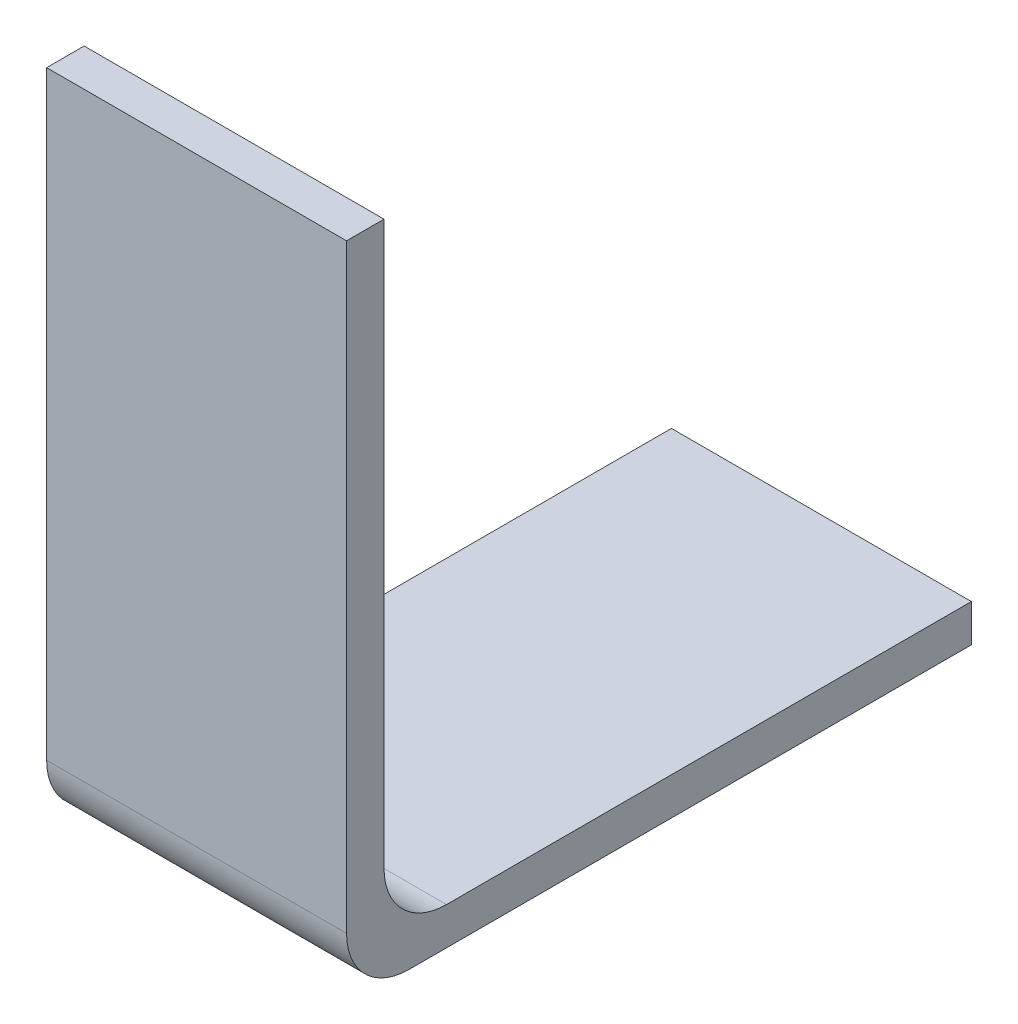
ISO-10303-21;
HEADER;
FILE_DESCRIPTION(('STEP AP214'),'2;1');
FILE_NAME('part.step','',(''),(''),'','','');
FILE_SCHEMA(('AUTOMOTIVE_DESIGN { 1 0 10303 214 1 1 1 1 }'));
ENDSEC;
DATA;
#1=APPLICATION_CONTEXT('core data for automotive mechanical design processes');
#2=APPLICATION_PROTOCOL_DEFINITION('international standard','automotive_design',2000,#1);
#3=PRODUCT_CONTEXT('',#1,'mechanical');
#4=PRODUCT('Part','Part','',(#3));
#5=PRODUCT_RELATED_PRODUCT_CATEGORY('part','',(#4));
#6=PRODUCT_DEFINITION_FORMATION('','',#4);
#7=PRODUCT_DEFINITION_CONTEXT('part definition',#1,'design');
#8=PRODUCT_DEFINITION('design','',#6,#7);
#9=PRODUCT_DEFINITION_SHAPE('','',#8);
#10=(LENGTH_UNIT() NAMED_UNIT(*) SI_UNIT(.MILLI.,.METRE.));
#11=(NAMED_UNIT(*) PLANE_ANGLE_UNIT() SI_UNIT($,.RADIAN.));
#12=(NAMED_UNIT(*) SI_UNIT($,.STERADIAN.) SOLID_ANGLE_UNIT());
#13=UNCERTAINTY_MEASURE_WITH_UNIT(LENGTH_MEASURE(1.E-05),#10,'distance_accuracy_value','');
#14=(GEOMETRIC_REPRESENTATION_CONTEXT(3) GLOBAL_UNCERTAINTY_ASSIGNED_CONTEXT((#13)) GLOBAL_UNIT_ASSIGNED_CONTEXT((#10,
#11,#12)) REPRESENTATION_CONTEXT('',''));
#15=CARTESIAN_POINT('',(0.,0.,0.));
#16=DIRECTION('',(0.,0.,1.));
#17=DIRECTION('',(1.,0.,0.));
#18=AXIS2_PLACEMENT_3D('',#15,#16,#17);
#19=CARTESIAN_POINT('',(0.,0.,12.7));
#20=DIRECTION('',(0.,-1.,0.));
#21=DIRECTION('',(0.,0.,-1.));
#22=AXIS2_PLACEMENT_3D('',#19,#20,#21);
#23=PLANE('',#22);
#24=DIRECTION('',(0.,0.,-1.));
#25=VECTOR('',#24,1.);
#26=CARTESIAN_POINT('',(0.,0.,12.7));
#27=LINE('',#26,#25);
#28=CARTESIAN_POINT('',(0.,0.,10.668));
#29=VERTEX_POINT('',#28);
#30=CARTESIAN_POINT('',(0.,0.,0.));
#31=VERTEX_POINT('',#30);
#32=EDGE_CURVE('E139',#29,#31,#27,.T.);
#33=ORIENTED_EDGE('',*,*,#32,.F.);
#34=DIRECTION('',(-1.,0.,0.));
#35=VECTOR('',#34,1.);
#36=CARTESIAN_POINT('',(6.09600000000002,0.,10.6680000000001));
#37=LINE('',#36,#35);
#38=CARTESIAN_POINT('',(6.09600000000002,0.,10.6680000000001));
#39=VERTEX_POINT('',#38);
#40=EDGE_CURVE('E184',#29,#39,#37,.F.);
#41=ORIENTED_EDGE('',*,*,#40,.T.);
#42=DIRECTION('',(0.,0.,-1.));
#43=VECTOR('',#42,1.);
#44=CARTESIAN_POINT('',(6.09600000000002,0.,12.7000000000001));
#45=LINE('',#44,#43);
#46=CARTESIAN_POINT('',(6.09600000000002,0.,0.));
#47=VERTEX_POINT('',#46);
#48=EDGE_CURVE('E135',#39,#47,#45,.T.);
#49=ORIENTED_EDGE('',*,*,#48,.T.);
#50=DIRECTION('',(-1.,0.,0.));
#51=VECTOR('',#50,1.);
#52=CARTESIAN_POINT('',(0.,0.,0.));
#53=LINE('',#52,#51);
#54=EDGE_CURVE('E168',#47,#31,#53,.T.);
#55=ORIENTED_EDGE('',*,*,#54,.T.);
#56=EDGE_LOOP('',(#33,#41,#49,#55));
#57=FACE_BOUND('',#56,.T.);
#58=ADVANCED_FACE('F33',(#57),#23,.F.);
#59=CARTESIAN_POINT('',(0.,0.,12.7));
#60=DIRECTION('',(1.,0.,0.));
#61=DIRECTION('',(0.,1.,0.));
#62=AXIS2_PLACEMENT_3D('',#59,#60,#61);
#63=PLANE('',#62);
#64=DIRECTION('',(0.,0.,-1.));
#65=VECTOR('',#64,1.);
#66=CARTESIAN_POINT('',(0.,-0.762000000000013,12.7));
#67=LINE('',#66,#65);
#68=CARTESIAN_POINT('',(0.,-0.761999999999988,11.43));
#69=VERTEX_POINT('',#68);
#70=CARTESIAN_POINT('',(0.,-0.762000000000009,0.));
#71=VERTEX_POINT('',#70);
#72=EDGE_CURVE('E134',#69,#71,#67,.T.);
#73=ORIENTED_EDGE('',*,*,#72,.F.);
#74=CARTESIAN_POINT('',(0.,0.507999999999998,11.43));
#75=DIRECTION('',(1.,0.,0.));
#76=DIRECTION('',(0.,1.,0.));
#77=AXIS2_PLACEMENT_3D('',#74,#75,#76);
#78=CIRCLE('',#77,1.27);
#79=CARTESIAN_POINT('',(0.,0.507999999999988,12.7));
#80=VERTEX_POINT('',#79);
#81=EDGE_CURVE('E179',#69,#80,#78,.F.);
#82=ORIENTED_EDGE('',*,*,#81,.T.);
#83=DIRECTION('',(0.,-1.,0.));
#84=VECTOR('',#83,1.);
#85=CARTESIAN_POINT('',(0.,0.,12.7));
#86=LINE('',#85,#84);
#87=CARTESIAN_POINT('',(0.,12.7,12.7));
#88=VERTEX_POINT('',#87);
#89=EDGE_CURVE('E169',#88,#80,#86,.T.);
#90=ORIENTED_EDGE('',*,*,#89,.F.);
#91=DIRECTION('',(0.,0.,1.));
#92=VECTOR('',#91,1.);
#93=CARTESIAN_POINT('',(0.,12.7,12.7));
#94=LINE('',#93,#92);
#95=CARTESIAN_POINT('',(0.,12.7,11.938));
#96=VERTEX_POINT('',#95);
#97=EDGE_CURVE('E105',#96,#88,#94,.T.);
#98=ORIENTED_EDGE('',*,*,#97,.F.);
#99=DIRECTION('',(0.,-1.,0.));
#100=VECTOR('',#99,1.);
#101=CARTESIAN_POINT('',(0.,12.7,11.938));
#102=LINE('',#101,#100);
#103=CARTESIAN_POINT('',(0.,1.27000000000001,11.938));
#104=VERTEX_POINT('',#103);
#105=EDGE_CURVE('E101',#96,#104,#102,.T.);
#106=ORIENTED_EDGE('',*,*,#105,.T.);
#107=CARTESIAN_POINT('',(0.,1.27,10.668));
#108=DIRECTION('',(1.,0.,0.));
#109=DIRECTION('',(0.,1.,0.));
#110=AXIS2_PLACEMENT_3D('',#107,#108,#109);
#111=CIRCLE('',#110,1.27);
#112=EDGE_CURVE('E41',#104,#29,#111,.T.);
#113=ORIENTED_EDGE('',*,*,#112,.T.);
#114=ORIENTED_EDGE('',*,*,#32,.T.);
#115=DIRECTION('',(0.,-1.,0.));
#116=VECTOR('',#115,1.);
#117=CARTESIAN_POINT('',(0.,0.,0.));
#118=LINE('',#117,#116);
#119=EDGE_CURVE('E119',#31,#71,#118,.T.);
#120=ORIENTED_EDGE('',*,*,#119,.T.);
#121=EDGE_LOOP('',(#73,#82,#90,#98,#106,#113,#114,#120));
#122=FACE_BOUND('',#121,.T.);
#123=ADVANCED_FACE('F35',(#122),#63,.F.);
#124=CARTESIAN_POINT('',(0.,-0.762000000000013,12.7));
#125=DIRECTION('',(0.,1.,0.));
#126=DIRECTION('',(0.,0.,1.));
#127=AXIS2_PLACEMENT_3D('',#124,#125,#126);
#128=PLANE('',#127);
#129=DIRECTION('',(0.,0.,-1.));
#130=VECTOR('',#129,1.);
#131=CARTESIAN_POINT('',(6.09600000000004,-0.762000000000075,12.7));
#132=LINE('',#131,#130);
#133=CARTESIAN_POINT('',(6.09600000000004,-0.762000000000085,11.43));
#134=VERTEX_POINT('',#133);
#135=CARTESIAN_POINT('',(6.09600000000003,-0.762000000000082,0.));
#136=VERTEX_POINT('',#135);
#137=EDGE_CURVE('E138',#134,#136,#132,.T.);
#138=ORIENTED_EDGE('',*,*,#137,.F.);
#139=DIRECTION('',(1.,0.,0.));
#140=VECTOR('',#139,1.);
#141=CARTESIAN_POINT('',(0.,-0.761999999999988,11.43));
#142=LINE('',#141,#140);
#143=EDGE_CURVE('E155',#134,#69,#142,.F.);
#144=ORIENTED_EDGE('',*,*,#143,.T.);
#145=ORIENTED_EDGE('',*,*,#72,.T.);
#146=DIRECTION('',(1.,0.,0.));
#147=VECTOR('',#146,1.);
#148=CARTESIAN_POINT('',(0.,-0.762000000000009,0.));
#149=LINE('',#148,#147);
#150=EDGE_CURVE('E122',#71,#136,#149,.T.);
#151=ORIENTED_EDGE('',*,*,#150,.T.);
#152=EDGE_LOOP('',(#138,#144,#145,#151));
#153=FACE_BOUND('',#152,.T.);
#154=ADVANCED_FACE('F152',(#153),#128,.F.);
#155=CARTESIAN_POINT('',(6.09600000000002,0.,12.7000000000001));
#156=DIRECTION('',(-1.,0.,0.));
#157=DIRECTION('',(0.,0.,1.));
#158=AXIS2_PLACEMENT_3D('',#155,#156,#157);
#159=PLANE('',#158);
#160=DIRECTION('',(0.,1.,0.));
#161=VECTOR('',#160,1.);
#162=CARTESIAN_POINT('',(6.09600000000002,0.,12.7000000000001));
#163=LINE('',#162,#161);
#164=CARTESIAN_POINT('',(6.09600000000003,0.507999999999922,12.7));
#165=VERTEX_POINT('',#164);
#166=CARTESIAN_POINT('',(6.09599999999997,12.7,12.7));
#167=VERTEX_POINT('',#166);
#168=EDGE_CURVE('E166',#165,#167,#163,.T.);
#169=ORIENTED_EDGE('',*,*,#168,.F.);
#170=CARTESIAN_POINT('',(6.09600000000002,0.507999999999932,11.43));
#171=DIRECTION('',(-1.,0.,0.));
#172=DIRECTION('',(0.,0.,1.));
#173=AXIS2_PLACEMENT_3D('',#170,#171,#172);
#174=CIRCLE('',#173,1.27);
#175=EDGE_CURVE('E133',#165,#134,#174,.F.);
#176=ORIENTED_EDGE('',*,*,#175,.T.);
#177=ORIENTED_EDGE('',*,*,#137,.T.);
#178=DIRECTION('',(0.,1.,0.));
#179=VECTOR('',#178,1.);
#180=CARTESIAN_POINT('',(6.09600000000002,0.,0.));
#181=LINE('',#180,#179);
#182=EDGE_CURVE('E162',#136,#47,#181,.T.);
#183=ORIENTED_EDGE('',*,*,#182,.T.);
#184=ORIENTED_EDGE('',*,*,#48,.F.);
#185=CARTESIAN_POINT('',(6.09600000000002,1.26999999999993,10.668));
#186=DIRECTION('',(-1.,0.,0.));
#187=DIRECTION('',(0.,0.,1.));
#188=AXIS2_PLACEMENT_3D('',#185,#186,#187);
#189=CIRCLE('',#188,1.27);
#190=CARTESIAN_POINT('',(6.09600000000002,1.26999999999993,11.938));
#191=VERTEX_POINT('',#190);
#192=EDGE_CURVE('E11',#39,#191,#189,.T.);
#193=ORIENTED_EDGE('',*,*,#192,.T.);
#194=DIRECTION('',(0.,-1.,0.));
#195=VECTOR('',#194,1.);
#196=CARTESIAN_POINT('',(6.09599999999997,12.7,11.938));
#197=LINE('',#196,#195);
#198=CARTESIAN_POINT('',(6.09599999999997,12.7,11.938));
#199=VERTEX_POINT('',#198);
#200=EDGE_CURVE('E100',#199,#191,#197,.T.);
#201=ORIENTED_EDGE('',*,*,#200,.F.);
#202=DIRECTION('',(0.,0.,-1.));
#203=VECTOR('',#202,1.);
#204=CARTESIAN_POINT('',(6.09599999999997,12.7,12.7));
#205=LINE('',#204,#203);
#206=EDGE_CURVE('E106',#167,#199,#205,.T.);
#207=ORIENTED_EDGE('',*,*,#206,.F.);
#208=EDGE_LOOP('',(#169,#176,#177,#183,#184,#193,#201,#207));
#209=FACE_BOUND('',#208,.T.);
#210=ADVANCED_FACE('F116',(#209),#159,.F.);
#211=CARTESIAN_POINT('',(0.,-0.762000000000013,12.7));
#212=DIRECTION('',(0.,0.,1.));
#213=DIRECTION('',(1.,0.,0.));
#214=AXIS2_PLACEMENT_3D('',#211,#212,#213);
#215=PLANE('',#214);
#216=ORIENTED_EDGE('',*,*,#89,.T.);
#217=DIRECTION('',(1.,0.,0.));
#218=VECTOR('',#217,1.);
#219=CARTESIAN_POINT('',(6.09600000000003,0.507999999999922,12.7));
#220=LINE('',#219,#218);
#221=EDGE_CURVE('E130',#80,#165,#220,.T.);
#222=ORIENTED_EDGE('',*,*,#221,.T.);
#223=ORIENTED_EDGE('',*,*,#168,.T.);
#224=DIRECTION('',(1.,0.,0.));
#225=VECTOR('',#224,1.);
#226=CARTESIAN_POINT('',(6.09599999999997,12.7,12.7));
#227=LINE('',#226,#225);
#228=EDGE_CURVE('E112',#88,#167,#227,.T.);
#229=ORIENTED_EDGE('',*,*,#228,.F.);
#230=EDGE_LOOP('',(#216,#222,#223,#229));
#231=FACE_BOUND('',#230,.T.);
#232=ADVANCED_FACE('F175',(#231),#215,.T.);
#233=CARTESIAN_POINT('',(0.,-0.762000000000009,0.));
#234=DIRECTION('',(0.,0.,1.));
#235=DIRECTION('',(1.,0.,0.));
#236=AXIS2_PLACEMENT_3D('',#233,#234,#235);
#237=PLANE('',#236);
#238=ORIENTED_EDGE('',*,*,#119,.F.);
#239=ORIENTED_EDGE('',*,*,#54,.F.);
#240=ORIENTED_EDGE('',*,*,#182,.F.);
#241=ORIENTED_EDGE('',*,*,#150,.F.);
#242=EDGE_LOOP('',(#238,#239,#240,#241));
#243=FACE_BOUND('',#242,.T.);
#244=ADVANCED_FACE('F159',(#243),#237,.F.);
#245=CARTESIAN_POINT('',(6.09599999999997,12.7,11.938));
#246=DIRECTION('',(0.,0.,1.));
#247=DIRECTION('',(1.,0.,0.));
#248=AXIS2_PLACEMENT_3D('',#245,#246,#247);
#249=PLANE('',#248);
#250=ORIENTED_EDGE('',*,*,#200,.T.);
#251=DIRECTION('',(-1.,0.,0.));
#252=VECTOR('',#251,1.);
#253=CARTESIAN_POINT('',(0.,1.27000000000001,11.938));
#254=LINE('',#253,#252);
#255=EDGE_CURVE('E180',#191,#104,#254,.T.);
#256=ORIENTED_EDGE('',*,*,#255,.T.);
#257=ORIENTED_EDGE('',*,*,#105,.F.);
#258=DIRECTION('',(-1.,0.,0.));
#259=VECTOR('',#258,1.);
#260=CARTESIAN_POINT('',(6.09599999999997,12.7,11.938));
#261=LINE('',#260,#259);
#262=EDGE_CURVE('E96',#199,#96,#261,.T.);
#263=ORIENTED_EDGE('',*,*,#262,.F.);
#264=EDGE_LOOP('',(#250,#256,#257,#263));
#265=FACE_BOUND('',#264,.T.);
#266=ADVANCED_FACE('F98',(#265),#249,.F.);
#267=CARTESIAN_POINT('',(6.09599999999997,12.7,11.938));
#268=DIRECTION('',(0.,1.,0.));
#269=DIRECTION('',(0.,0.,1.));
#270=AXIS2_PLACEMENT_3D('',#267,#268,#269);
#271=PLANE('',#270);
#272=ORIENTED_EDGE('',*,*,#206,.T.);
#273=ORIENTED_EDGE('',*,*,#262,.T.);
#274=ORIENTED_EDGE('',*,*,#97,.T.);
#275=ORIENTED_EDGE('',*,*,#228,.T.);
#276=EDGE_LOOP('',(#272,#273,#274,#275));
#277=FACE_BOUND('',#276,.T.);
#278=ADVANCED_FACE('F110',(#277),#271,.T.);
#279=CARTESIAN_POINT('',(0.,0.507999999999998,11.43));
#280=DIRECTION('',(-1.,0.,0.));
#281=DIRECTION('',(0.,0.,1.));
#282=AXIS2_PLACEMENT_3D('',#279,#280,#281);
#283=CYLINDRICAL_SURFACE('',#282,1.27);
#284=ORIENTED_EDGE('',*,*,#81,.F.);
#285=ORIENTED_EDGE('',*,*,#143,.F.);
#286=ORIENTED_EDGE('',*,*,#175,.F.);
#287=ORIENTED_EDGE('',*,*,#221,.F.);
#288=EDGE_LOOP('',(#284,#285,#286,#287));
#289=FACE_BOUND('',#288,.T.);
#290=ADVANCED_FACE('F178',(#289),#283,.T.);
#291=CARTESIAN_POINT('',(6.09600000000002,1.26999999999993,10.668));
#292=DIRECTION('',(1.,0.,0.));
#293=DIRECTION('',(0.,0.,-1.));
#294=AXIS2_PLACEMENT_3D('',#291,#292,#293);
#295=CYLINDRICAL_SURFACE('',#294,1.27);
#296=ORIENTED_EDGE('',*,*,#192,.F.);
#297=ORIENTED_EDGE('',*,*,#40,.F.);
#298=ORIENTED_EDGE('',*,*,#112,.F.);
#299=ORIENTED_EDGE('',*,*,#255,.F.);
#300=EDGE_LOOP('',(#296,#297,#298,#299));
#301=FACE_BOUND('',#300,.T.);
#302=ADVANCED_FACE('F185',(#301),#295,.F.);
#303=CLOSED_SHELL('',(#58,#123,#154,#210,#232,#244,#266,#278,#290,#302));
#304=MANIFOLD_SOLID_BREP('B2',#303);
#305=ADVANCED_BREP_SHAPE_REPRESENTATION('',(#18,#304),#14);
#306=SHAPE_DEFINITION_REPRESENTATION(#9,#305);
ENDSEC;
END-ISO-10303-21;
